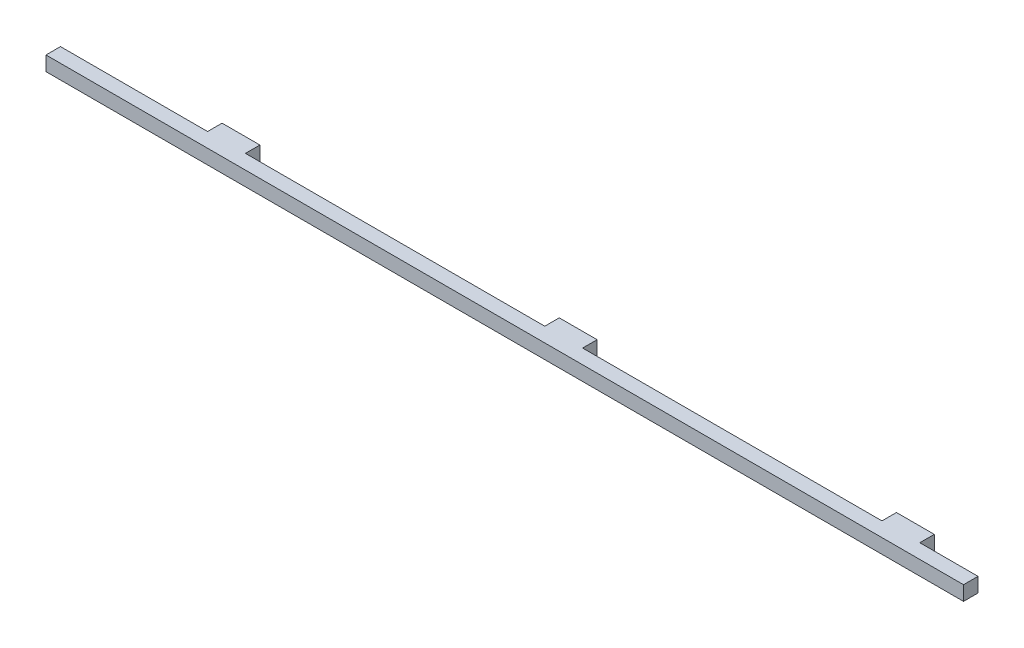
ISO-10303-21;
HEADER;
FILE_DESCRIPTION(('STEP AP214'),'2;1');
FILE_NAME('part.step','',(''),(''),'','','');
FILE_SCHEMA(('AUTOMOTIVE_DESIGN { 1 0 10303 214 1 1 1 1 }'));
ENDSEC;
DATA;
#1=APPLICATION_CONTEXT('core data for automotive mechanical design processes');
#2=APPLICATION_PROTOCOL_DEFINITION('international standard','automotive_design',2000,#1);
#3=PRODUCT_CONTEXT('',#1,'mechanical');
#4=PRODUCT('Part','Part','',(#3));
#5=PRODUCT_RELATED_PRODUCT_CATEGORY('part','',(#4));
#6=PRODUCT_DEFINITION_FORMATION('','',#4);
#7=PRODUCT_DEFINITION_CONTEXT('part definition',#1,'design');
#8=PRODUCT_DEFINITION('design','',#6,#7);
#9=PRODUCT_DEFINITION_SHAPE('','',#8);
#10=(LENGTH_UNIT() NAMED_UNIT(*) SI_UNIT(.MILLI.,.METRE.));
#11=(NAMED_UNIT(*) PLANE_ANGLE_UNIT() SI_UNIT($,.RADIAN.));
#12=(NAMED_UNIT(*) SI_UNIT($,.STERADIAN.) SOLID_ANGLE_UNIT());
#13=UNCERTAINTY_MEASURE_WITH_UNIT(LENGTH_MEASURE(1.E-05),#10,'distance_accuracy_value','');
#14=(GEOMETRIC_REPRESENTATION_CONTEXT(3) GLOBAL_UNCERTAINTY_ASSIGNED_CONTEXT((#13)) GLOBAL_UNIT_ASSIGNED_CONTEXT((#10,
#11,#12)) REPRESENTATION_CONTEXT('',''));
#15=CARTESIAN_POINT('',(0.,0.,0.));
#16=DIRECTION('',(0.,0.,1.));
#17=DIRECTION('',(1.,0.,0.));
#18=AXIS2_PLACEMENT_3D('',#15,#16,#17);
#19=CARTESIAN_POINT('',(-273.841357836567,3.,-103.580258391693));
#20=DIRECTION('',(-1.,0.,0.));
#21=DIRECTION('',(0.,0.,1.));
#22=AXIS2_PLACEMENT_3D('',#19,#20,#21);
#23=PLANE('',#22);
#24=DIRECTION('',(0.,0.,-1.));
#25=VECTOR('',#24,1.);
#26=CARTESIAN_POINT('',(-273.841357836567,0.,-103.580258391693));
#27=LINE('',#26,#25);
#28=CARTESIAN_POINT('',(-273.841357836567,0.,-100.580258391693));
#29=VERTEX_POINT('',#28);
#30=CARTESIAN_POINT('',(-273.841357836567,0.,-103.580258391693));
#31=VERTEX_POINT('',#30);
#32=EDGE_CURVE('E176',#29,#31,#27,.T.);
#33=ORIENTED_EDGE('',*,*,#32,.T.);
#34=DIRECTION('',(0.,-1.,0.));
#35=VECTOR('',#34,1.);
#36=CARTESIAN_POINT('',(-273.841357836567,3.,-103.580258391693));
#37=LINE('',#36,#35);
#38=CARTESIAN_POINT('',(-273.841357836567,3.,-103.580258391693));
#39=VERTEX_POINT('',#38);
#40=EDGE_CURVE('E11',#39,#31,#37,.T.);
#41=ORIENTED_EDGE('',*,*,#40,.F.);
#42=DIRECTION('',(0.,0.,-1.));
#43=VECTOR('',#42,1.);
#44=CARTESIAN_POINT('',(-273.841357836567,3.,-103.580258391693));
#45=LINE('',#44,#43);
#46=CARTESIAN_POINT('',(-273.841357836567,3.,-100.580258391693));
#47=VERTEX_POINT('',#46);
#48=EDGE_CURVE('E206',#47,#39,#45,.T.);
#49=ORIENTED_EDGE('',*,*,#48,.F.);
#50=DIRECTION('',(0.,-1.,0.));
#51=VECTOR('',#50,1.);
#52=CARTESIAN_POINT('',(-273.841357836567,3.,-100.580258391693));
#53=LINE('',#52,#51);
#54=EDGE_CURVE('E172',#47,#29,#53,.T.);
#55=ORIENTED_EDGE('',*,*,#54,.T.);
#56=EDGE_LOOP('',(#33,#41,#49,#55));
#57=FACE_BOUND('',#56,.T.);
#58=ADVANCED_FACE('F32',(#57),#23,.F.);
#59=CARTESIAN_POINT('',(-281.679657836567,3.,-103.580258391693));
#60=DIRECTION('',(0.,0.,1.));
#61=DIRECTION('',(1.,0.,0.));
#62=AXIS2_PLACEMENT_3D('',#59,#60,#61);
#63=PLANE('',#62);
#64=DIRECTION('',(-1.,0.,0.));
#65=VECTOR('',#64,1.);
#66=CARTESIAN_POINT('',(-281.679657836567,0.,-103.580258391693));
#67=LINE('',#66,#65);
#68=CARTESIAN_POINT('',(-281.679657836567,0.,-103.580258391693));
#69=VERTEX_POINT('',#68);
#70=EDGE_CURVE('E179',#31,#69,#67,.T.);
#71=ORIENTED_EDGE('',*,*,#70,.T.);
#72=DIRECTION('',(0.,-1.,0.));
#73=VECTOR('',#72,1.);
#74=CARTESIAN_POINT('',(-281.679657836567,3.,-103.580258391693));
#75=LINE('',#74,#73);
#76=CARTESIAN_POINT('',(-281.679657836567,3.,-103.580258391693));
#77=VERTEX_POINT('',#76);
#78=EDGE_CURVE('E40',#77,#69,#75,.T.);
#79=ORIENTED_EDGE('',*,*,#78,.F.);
#80=DIRECTION('',(-1.,0.,0.));
#81=VECTOR('',#80,1.);
#82=CARTESIAN_POINT('',(-281.679657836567,3.,-103.580258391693));
#83=LINE('',#82,#81);
#84=EDGE_CURVE('E115',#39,#77,#83,.T.);
#85=ORIENTED_EDGE('',*,*,#84,.F.);
#86=ORIENTED_EDGE('',*,*,#40,.T.);
#87=EDGE_LOOP('',(#71,#79,#85,#86));
#88=FACE_BOUND('',#87,.T.);
#89=ADVANCED_FACE('F304',(#88),#63,.F.);
#90=CARTESIAN_POINT('',(-281.679657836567,3.,-103.580258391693));
#91=DIRECTION('',(1.,0.,0.));
#92=DIRECTION('',(0.,0.,-1.));
#93=AXIS2_PLACEMENT_3D('',#90,#91,#92);
#94=PLANE('',#93);
#95=DIRECTION('',(0.,0.,1.));
#96=VECTOR('',#95,1.);
#97=CARTESIAN_POINT('',(-281.679657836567,0.,-103.580258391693));
#98=LINE('',#97,#96);
#99=CARTESIAN_POINT('',(-281.679657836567,0.,-100.580258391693));
#100=VERTEX_POINT('',#99);
#101=EDGE_CURVE('E181',#69,#100,#98,.T.);
#102=ORIENTED_EDGE('',*,*,#101,.T.);
#103=DIRECTION('',(0.,-1.,0.));
#104=VECTOR('',#103,1.);
#105=CARTESIAN_POINT('',(-281.679657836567,3.,-100.580258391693));
#106=LINE('',#105,#104);
#107=CARTESIAN_POINT('',(-281.679657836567,3.,-100.580258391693));
#108=VERTEX_POINT('',#107);
#109=EDGE_CURVE('E237',#108,#100,#106,.T.);
#110=ORIENTED_EDGE('',*,*,#109,.F.);
#111=DIRECTION('',(0.,0.,1.));
#112=VECTOR('',#111,1.);
#113=CARTESIAN_POINT('',(-281.679657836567,3.,-103.580258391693));
#114=LINE('',#113,#112);
#115=EDGE_CURVE('E245',#77,#108,#114,.T.);
#116=ORIENTED_EDGE('',*,*,#115,.F.);
#117=ORIENTED_EDGE('',*,*,#78,.T.);
#118=EDGE_LOOP('',(#102,#110,#116,#117));
#119=FACE_BOUND('',#118,.T.);
#120=ADVANCED_FACE('F243',(#119),#94,.F.);
#121=CARTESIAN_POINT('',(-281.679657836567,3.,-100.580258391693));
#122=DIRECTION('',(0.,0.,1.));
#123=DIRECTION('',(1.,0.,0.));
#124=AXIS2_PLACEMENT_3D('',#121,#122,#123);
#125=PLANE('',#124);
#126=DIRECTION('',(-1.,0.,0.));
#127=VECTOR('',#126,1.);
#128=CARTESIAN_POINT('',(-281.679657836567,0.,-100.580258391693));
#129=LINE('',#128,#127);
#130=CARTESIAN_POINT('',(-312.140557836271,0.,-100.580258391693));
#131=VERTEX_POINT('',#130);
#132=EDGE_CURVE('E183',#100,#131,#129,.T.);
#133=ORIENTED_EDGE('',*,*,#132,.T.);
#134=DIRECTION('',(0.,-1.,0.));
#135=VECTOR('',#134,1.);
#136=CARTESIAN_POINT('',(-312.140557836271,3.,-100.580258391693));
#137=LINE('',#136,#135);
#138=CARTESIAN_POINT('',(-312.140557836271,3.,-100.580258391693));
#139=VERTEX_POINT('',#138);
#140=EDGE_CURVE('E234',#139,#131,#137,.T.);
#141=ORIENTED_EDGE('',*,*,#140,.F.);
#142=DIRECTION('',(-1.,0.,0.));
#143=VECTOR('',#142,1.);
#144=CARTESIAN_POINT('',(-281.679657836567,3.,-100.580258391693));
#145=LINE('',#144,#143);
#146=EDGE_CURVE('E263',#108,#139,#145,.T.);
#147=ORIENTED_EDGE('',*,*,#146,.F.);
#148=ORIENTED_EDGE('',*,*,#109,.T.);
#149=EDGE_LOOP('',(#133,#141,#147,#148));
#150=FACE_BOUND('',#149,.T.);
#151=ADVANCED_FACE('F254',(#150),#125,.F.);
#152=CARTESIAN_POINT('',(-312.140557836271,3.,-100.580258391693));
#153=DIRECTION('',(1.,0.,0.));
#154=DIRECTION('',(0.,0.,-1.));
#155=AXIS2_PLACEMENT_3D('',#152,#153,#154);
#156=PLANE('',#155);
#157=DIRECTION('',(0.,0.,1.));
#158=VECTOR('',#157,1.);
#159=CARTESIAN_POINT('',(-312.140557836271,0.,-100.580258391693));
#160=LINE('',#159,#158);
#161=CARTESIAN_POINT('',(-312.140557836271,0.,-97.5802583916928));
#162=VERTEX_POINT('',#161);
#163=EDGE_CURVE('E185',#131,#162,#160,.T.);
#164=ORIENTED_EDGE('',*,*,#163,.T.);
#165=DIRECTION('',(0.,-1.,0.));
#166=VECTOR('',#165,1.);
#167=CARTESIAN_POINT('',(-312.140557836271,3.,-97.5802583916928));
#168=LINE('',#167,#166);
#169=CARTESIAN_POINT('',(-312.140557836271,3.,-97.5802583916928));
#170=VERTEX_POINT('',#169);
#171=EDGE_CURVE('E231',#170,#162,#168,.T.);
#172=ORIENTED_EDGE('',*,*,#171,.F.);
#173=DIRECTION('',(0.,0.,1.));
#174=VECTOR('',#173,1.);
#175=CARTESIAN_POINT('',(-312.140557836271,3.,-100.580258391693));
#176=LINE('',#175,#174);
#177=EDGE_CURVE('E260',#139,#170,#176,.T.);
#178=ORIENTED_EDGE('',*,*,#177,.F.);
#179=ORIENTED_EDGE('',*,*,#140,.T.);
#180=EDGE_LOOP('',(#164,#172,#178,#179));
#181=FACE_BOUND('',#180,.T.);
#182=ADVANCED_FACE('F258',(#181),#156,.F.);
#183=CARTESIAN_POINT('',(-312.140557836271,3.,-97.5802583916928));
#184=DIRECTION('',(0.,0.,-1.));
#185=DIRECTION('',(-1.,0.,0.));
#186=AXIS2_PLACEMENT_3D('',#183,#184,#185);
#187=PLANE('',#186);
#188=DIRECTION('',(1.,0.,0.));
#189=VECTOR('',#188,1.);
#190=CARTESIAN_POINT('',(-312.140557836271,0.,-97.5802583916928));
#191=LINE('',#190,#189);
#192=CARTESIAN_POINT('',(-122.140557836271,0.,-97.5802583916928));
#193=VERTEX_POINT('',#192);
#194=EDGE_CURVE('E187',#162,#193,#191,.T.);
#195=ORIENTED_EDGE('',*,*,#194,.T.);
#196=DIRECTION('',(0.,-1.,0.));
#197=VECTOR('',#196,1.);
#198=CARTESIAN_POINT('',(-122.140557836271,3.,-97.5802583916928));
#199=LINE('',#198,#197);
#200=CARTESIAN_POINT('',(-122.140557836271,3.,-97.5802583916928));
#201=VERTEX_POINT('',#200);
#202=EDGE_CURVE('E228',#201,#193,#199,.T.);
#203=ORIENTED_EDGE('',*,*,#202,.F.);
#204=DIRECTION('',(1.,0.,0.));
#205=VECTOR('',#204,1.);
#206=CARTESIAN_POINT('',(-312.140557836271,3.,-97.5802583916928));
#207=LINE('',#206,#205);
#208=EDGE_CURVE('E262',#170,#201,#207,.T.);
#209=ORIENTED_EDGE('',*,*,#208,.F.);
#210=ORIENTED_EDGE('',*,*,#171,.T.);
#211=EDGE_LOOP('',(#195,#203,#209,#210));
#212=FACE_BOUND('',#211,.T.);
#213=ADVANCED_FACE('F317',(#212),#187,.F.);
#214=CARTESIAN_POINT('',(-122.140557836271,3.,-97.5802583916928));
#215=DIRECTION('',(-1.,0.,0.));
#216=DIRECTION('',(0.,0.,1.));
#217=AXIS2_PLACEMENT_3D('',#214,#215,#216);
#218=PLANE('',#217);
#219=DIRECTION('',(0.,0.,-1.));
#220=VECTOR('',#219,1.);
#221=CARTESIAN_POINT('',(-122.140557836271,0.,-97.5802583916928));
#222=LINE('',#221,#220);
#223=CARTESIAN_POINT('',(-122.140557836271,0.,-100.580258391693));
#224=VERTEX_POINT('',#223);
#225=EDGE_CURVE('E189',#193,#224,#222,.T.);
#226=ORIENTED_EDGE('',*,*,#225,.T.);
#227=DIRECTION('',(0.,-1.,0.));
#228=VECTOR('',#227,1.);
#229=CARTESIAN_POINT('',(-122.140557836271,3.,-100.580258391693));
#230=LINE('',#229,#228);
#231=CARTESIAN_POINT('',(-122.140557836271,3.,-100.580258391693));
#232=VERTEX_POINT('',#231);
#233=EDGE_CURVE('E225',#232,#224,#230,.T.);
#234=ORIENTED_EDGE('',*,*,#233,.F.);
#235=DIRECTION('',(0.,0.,-1.));
#236=VECTOR('',#235,1.);
#237=CARTESIAN_POINT('',(-122.140557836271,3.,-97.5802583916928));
#238=LINE('',#237,#236);
#239=EDGE_CURVE('E265',#201,#232,#238,.T.);
#240=ORIENTED_EDGE('',*,*,#239,.F.);
#241=ORIENTED_EDGE('',*,*,#202,.T.);
#242=EDGE_LOOP('',(#226,#234,#240,#241));
#243=FACE_BOUND('',#242,.T.);
#244=ADVANCED_FACE('F320',(#243),#218,.F.);
#245=CARTESIAN_POINT('',(-134.190457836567,3.,-100.580258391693));
#246=DIRECTION('',(0.,0.,1.));
#247=DIRECTION('',(1.,0.,0.));
#248=AXIS2_PLACEMENT_3D('',#245,#246,#247);
#249=PLANE('',#248);
#250=DIRECTION('',(-1.,0.,0.));
#251=VECTOR('',#250,1.);
#252=CARTESIAN_POINT('',(-134.190457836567,0.,-100.580258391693));
#253=LINE('',#252,#251);
#254=CARTESIAN_POINT('',(-134.190457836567,0.,-100.580258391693));
#255=VERTEX_POINT('',#254);
#256=EDGE_CURVE('E191',#224,#255,#253,.T.);
#257=ORIENTED_EDGE('',*,*,#256,.T.);
#258=DIRECTION('',(0.,-1.,0.));
#259=VECTOR('',#258,1.);
#260=CARTESIAN_POINT('',(-134.190457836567,3.,-100.580258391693));
#261=LINE('',#260,#259);
#262=CARTESIAN_POINT('',(-134.190457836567,3.,-100.580258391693));
#263=VERTEX_POINT('',#262);
#264=EDGE_CURVE('E222',#263,#255,#261,.T.);
#265=ORIENTED_EDGE('',*,*,#264,.F.);
#266=DIRECTION('',(-1.,0.,0.));
#267=VECTOR('',#266,1.);
#268=CARTESIAN_POINT('',(-134.190457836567,3.,-100.580258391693));
#269=LINE('',#268,#267);
#270=EDGE_CURVE('E271',#232,#263,#269,.T.);
#271=ORIENTED_EDGE('',*,*,#270,.F.);
#272=ORIENTED_EDGE('',*,*,#233,.T.);
#273=EDGE_LOOP('',(#257,#265,#271,#272));
#274=FACE_BOUND('',#273,.T.);
#275=ADVANCED_FACE('F324',(#274),#249,.F.);
#276=CARTESIAN_POINT('',(-134.190457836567,3.,-103.580258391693));
#277=DIRECTION('',(-1.,0.,0.));
#278=DIRECTION('',(0.,0.,1.));
#279=AXIS2_PLACEMENT_3D('',#276,#277,#278);
#280=PLANE('',#279);
#281=DIRECTION('',(0.,0.,-1.));
#282=VECTOR('',#281,1.);
#283=CARTESIAN_POINT('',(-134.190457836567,0.,-103.580258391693));
#284=LINE('',#283,#282);
#285=CARTESIAN_POINT('',(-134.190457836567,0.,-103.580258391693));
#286=VERTEX_POINT('',#285);
#287=EDGE_CURVE('E193',#255,#286,#284,.T.);
#288=ORIENTED_EDGE('',*,*,#287,.T.);
#289=DIRECTION('',(0.,-1.,0.));
#290=VECTOR('',#289,1.);
#291=CARTESIAN_POINT('',(-134.190457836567,3.,-103.580258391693));
#292=LINE('',#291,#290);
#293=CARTESIAN_POINT('',(-134.190457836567,3.,-103.580258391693));
#294=VERTEX_POINT('',#293);
#295=EDGE_CURVE('E219',#294,#286,#292,.T.);
#296=ORIENTED_EDGE('',*,*,#295,.F.);
#297=DIRECTION('',(0.,0.,-1.));
#298=VECTOR('',#297,1.);
#299=CARTESIAN_POINT('',(-134.190457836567,3.,-103.580258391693));
#300=LINE('',#299,#298);
#301=EDGE_CURVE('E273',#263,#294,#300,.T.);
#302=ORIENTED_EDGE('',*,*,#301,.F.);
#303=ORIENTED_EDGE('',*,*,#264,.T.);
#304=EDGE_LOOP('',(#288,#296,#302,#303));
#305=FACE_BOUND('',#304,.T.);
#306=ADVANCED_FACE('F328',(#305),#280,.F.);
#307=CARTESIAN_POINT('',(-142.028857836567,3.,-103.580258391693));
#308=DIRECTION('',(0.,0.,1.));
#309=DIRECTION('',(1.,0.,0.));
#310=AXIS2_PLACEMENT_3D('',#307,#308,#309);
#311=PLANE('',#310);
#312=DIRECTION('',(-1.,0.,0.));
#313=VECTOR('',#312,1.);
#314=CARTESIAN_POINT('',(-142.028857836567,0.,-103.580258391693));
#315=LINE('',#314,#313);
#316=CARTESIAN_POINT('',(-142.028857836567,0.,-103.580258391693));
#317=VERTEX_POINT('',#316);
#318=EDGE_CURVE('E195',#286,#317,#315,.T.);
#319=ORIENTED_EDGE('',*,*,#318,.T.);
#320=DIRECTION('',(0.,-1.,0.));
#321=VECTOR('',#320,1.);
#322=CARTESIAN_POINT('',(-142.028857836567,3.,-103.580258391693));
#323=LINE('',#322,#321);
#324=CARTESIAN_POINT('',(-142.028857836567,3.,-103.580258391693));
#325=VERTEX_POINT('',#324);
#326=EDGE_CURVE('E216',#325,#317,#323,.T.);
#327=ORIENTED_EDGE('',*,*,#326,.F.);
#328=DIRECTION('',(-1.,0.,0.));
#329=VECTOR('',#328,1.);
#330=CARTESIAN_POINT('',(-142.028857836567,3.,-103.580258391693));
#331=LINE('',#330,#329);
#332=EDGE_CURVE('E275',#294,#325,#331,.T.);
#333=ORIENTED_EDGE('',*,*,#332,.F.);
#334=ORIENTED_EDGE('',*,*,#295,.T.);
#335=EDGE_LOOP('',(#319,#327,#333,#334));
#336=FACE_BOUND('',#335,.T.);
#337=ADVANCED_FACE('F332',(#336),#311,.F.);
#338=CARTESIAN_POINT('',(-142.028857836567,3.,-103.580258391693));
#339=DIRECTION('',(1.,0.,0.));
#340=DIRECTION('',(0.,0.,-1.));
#341=AXIS2_PLACEMENT_3D('',#338,#339,#340);
#342=PLANE('',#341);
#343=DIRECTION('',(0.,0.,1.));
#344=VECTOR('',#343,1.);
#345=CARTESIAN_POINT('',(-142.028857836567,0.,-103.580258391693));
#346=LINE('',#345,#344);
#347=CARTESIAN_POINT('',(-142.028857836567,0.,-100.580258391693));
#348=VERTEX_POINT('',#347);
#349=EDGE_CURVE('E197',#317,#348,#346,.T.);
#350=ORIENTED_EDGE('',*,*,#349,.T.);
#351=DIRECTION('',(0.,-1.,0.));
#352=VECTOR('',#351,1.);
#353=CARTESIAN_POINT('',(-142.028857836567,3.,-100.580258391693));
#354=LINE('',#353,#352);
#355=CARTESIAN_POINT('',(-142.028857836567,3.,-100.580258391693));
#356=VERTEX_POINT('',#355);
#357=EDGE_CURVE('E213',#356,#348,#354,.T.);
#358=ORIENTED_EDGE('',*,*,#357,.F.);
#359=DIRECTION('',(0.,0.,1.));
#360=VECTOR('',#359,1.);
#361=CARTESIAN_POINT('',(-142.028857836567,3.,-103.580258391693));
#362=LINE('',#361,#360);
#363=EDGE_CURVE('E277',#325,#356,#362,.T.);
#364=ORIENTED_EDGE('',*,*,#363,.F.);
#365=ORIENTED_EDGE('',*,*,#326,.T.);
#366=EDGE_LOOP('',(#350,#358,#364,#365));
#367=FACE_BOUND('',#366,.T.);
#368=ADVANCED_FACE('F336',(#367),#342,.F.);
#369=CARTESIAN_POINT('',(-204.015857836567,3.,-100.580258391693));
#370=DIRECTION('',(0.,0.,1.));
#371=DIRECTION('',(1.,0.,0.));
#372=AXIS2_PLACEMENT_3D('',#369,#370,#371);
#373=PLANE('',#372);
#374=DIRECTION('',(-1.,0.,0.));
#375=VECTOR('',#374,1.);
#376=CARTESIAN_POINT('',(-204.015857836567,0.,-100.580258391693));
#377=LINE('',#376,#375);
#378=CARTESIAN_POINT('',(-204.015857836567,0.,-100.580258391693));
#379=VERTEX_POINT('',#378);
#380=EDGE_CURVE('E199',#348,#379,#377,.T.);
#381=ORIENTED_EDGE('',*,*,#380,.T.);
#382=DIRECTION('',(0.,-1.,0.));
#383=VECTOR('',#382,1.);
#384=CARTESIAN_POINT('',(-204.015857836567,3.,-100.580258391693));
#385=LINE('',#384,#383);
#386=CARTESIAN_POINT('',(-204.015857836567,3.,-100.580258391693));
#387=VERTEX_POINT('',#386);
#388=EDGE_CURVE('E210',#387,#379,#385,.T.);
#389=ORIENTED_EDGE('',*,*,#388,.F.);
#390=DIRECTION('',(-1.,0.,0.));
#391=VECTOR('',#390,1.);
#392=CARTESIAN_POINT('',(-204.015857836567,3.,-100.580258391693));
#393=LINE('',#392,#391);
#394=EDGE_CURVE('E279',#356,#387,#393,.T.);
#395=ORIENTED_EDGE('',*,*,#394,.F.);
#396=ORIENTED_EDGE('',*,*,#357,.T.);
#397=EDGE_LOOP('',(#381,#389,#395,#396));
#398=FACE_BOUND('',#397,.T.);
#399=ADVANCED_FACE('F285',(#398),#373,.F.);
#400=CARTESIAN_POINT('',(-204.015857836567,3.,-103.580258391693));
#401=DIRECTION('',(-1.,0.,0.));
#402=DIRECTION('',(0.,0.,1.));
#403=AXIS2_PLACEMENT_3D('',#400,#401,#402);
#404=PLANE('',#403);
#405=DIRECTION('',(0.,0.,-1.));
#406=VECTOR('',#405,1.);
#407=CARTESIAN_POINT('',(-204.015857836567,0.,-103.580258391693));
#408=LINE('',#407,#406);
#409=CARTESIAN_POINT('',(-204.015857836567,0.,-103.580258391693));
#410=VERTEX_POINT('',#409);
#411=EDGE_CURVE('E201',#379,#410,#408,.T.);
#412=ORIENTED_EDGE('',*,*,#411,.T.);
#413=DIRECTION('',(0.,-1.,0.));
#414=VECTOR('',#413,1.);
#415=CARTESIAN_POINT('',(-204.015857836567,3.,-103.580258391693));
#416=LINE('',#415,#414);
#417=CARTESIAN_POINT('',(-204.015857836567,3.,-103.580258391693));
#418=VERTEX_POINT('',#417);
#419=EDGE_CURVE('E167',#418,#410,#416,.T.);
#420=ORIENTED_EDGE('',*,*,#419,.F.);
#421=DIRECTION('',(0.,0.,-1.));
#422=VECTOR('',#421,1.);
#423=CARTESIAN_POINT('',(-204.015857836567,3.,-103.580258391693));
#424=LINE('',#423,#422);
#425=EDGE_CURVE('E158',#387,#418,#424,.T.);
#426=ORIENTED_EDGE('',*,*,#425,.F.);
#427=ORIENTED_EDGE('',*,*,#388,.T.);
#428=EDGE_LOOP('',(#412,#420,#426,#427));
#429=FACE_BOUND('',#428,.T.);
#430=ADVANCED_FACE('F289',(#429),#404,.F.);
#431=CARTESIAN_POINT('',(-211.854057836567,3.,-103.580258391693));
#432=DIRECTION('',(0.,0.,1.));
#433=DIRECTION('',(1.,0.,0.));
#434=AXIS2_PLACEMENT_3D('',#431,#432,#433);
#435=PLANE('',#434);
#436=DIRECTION('',(-1.,0.,0.));
#437=VECTOR('',#436,1.);
#438=CARTESIAN_POINT('',(-211.854057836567,0.,-103.580258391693));
#439=LINE('',#438,#437);
#440=CARTESIAN_POINT('',(-211.854057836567,0.,-103.580258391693));
#441=VERTEX_POINT('',#440);
#442=EDGE_CURVE('E166',#410,#441,#439,.T.);
#443=ORIENTED_EDGE('',*,*,#442,.T.);
#444=DIRECTION('',(0.,-1.,0.));
#445=VECTOR('',#444,1.);
#446=CARTESIAN_POINT('',(-211.854057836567,3.,-103.580258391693));
#447=LINE('',#446,#445);
#448=CARTESIAN_POINT('',(-211.854057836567,3.,-103.580258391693));
#449=VERTEX_POINT('',#448);
#450=EDGE_CURVE('E163',#449,#441,#447,.T.);
#451=ORIENTED_EDGE('',*,*,#450,.F.);
#452=DIRECTION('',(-1.,0.,0.));
#453=VECTOR('',#452,1.);
#454=CARTESIAN_POINT('',(-211.854057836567,3.,-103.580258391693));
#455=LINE('',#454,#453);
#456=EDGE_CURVE('E152',#418,#449,#455,.T.);
#457=ORIENTED_EDGE('',*,*,#456,.F.);
#458=ORIENTED_EDGE('',*,*,#419,.T.);
#459=EDGE_LOOP('',(#443,#451,#457,#458));
#460=FACE_BOUND('',#459,.T.);
#461=ADVANCED_FACE('F164',(#460),#435,.F.);
#462=CARTESIAN_POINT('',(-211.854057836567,3.,-103.580258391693));
#463=DIRECTION('',(1.,0.,0.));
#464=DIRECTION('',(0.,0.,-1.));
#465=AXIS2_PLACEMENT_3D('',#462,#463,#464);
#466=PLANE('',#465);
#467=DIRECTION('',(0.,0.,1.));
#468=VECTOR('',#467,1.);
#469=CARTESIAN_POINT('',(-211.854057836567,0.,-103.580258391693));
#470=LINE('',#469,#468);
#471=CARTESIAN_POINT('',(-211.854057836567,0.,-100.580258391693));
#472=VERTEX_POINT('',#471);
#473=EDGE_CURVE('E101',#441,#472,#470,.T.);
#474=ORIENTED_EDGE('',*,*,#473,.T.);
#475=DIRECTION('',(0.,-1.,0.));
#476=VECTOR('',#475,1.);
#477=CARTESIAN_POINT('',(-211.854057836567,3.,-100.580258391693));
#478=LINE('',#477,#476);
#479=CARTESIAN_POINT('',(-211.854057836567,3.,-100.580258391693));
#480=VERTEX_POINT('',#479);
#481=EDGE_CURVE('E168',#480,#472,#478,.T.);
#482=ORIENTED_EDGE('',*,*,#481,.F.);
#483=DIRECTION('',(0.,0.,1.));
#484=VECTOR('',#483,1.);
#485=CARTESIAN_POINT('',(-211.854057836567,3.,-103.580258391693));
#486=LINE('',#485,#484);
#487=EDGE_CURVE('E156',#449,#480,#486,.T.);
#488=ORIENTED_EDGE('',*,*,#487,.F.);
#489=ORIENTED_EDGE('',*,*,#450,.T.);
#490=EDGE_LOOP('',(#474,#482,#488,#489));
#491=FACE_BOUND('',#490,.T.);
#492=ADVANCED_FACE('F170',(#491),#466,.F.);
#493=CARTESIAN_POINT('',(-273.841357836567,3.,-100.580258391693));
#494=DIRECTION('',(0.,0.,1.));
#495=DIRECTION('',(1.,0.,0.));
#496=AXIS2_PLACEMENT_3D('',#493,#494,#495);
#497=PLANE('',#496);
#498=DIRECTION('',(-1.,0.,0.));
#499=VECTOR('',#498,1.);
#500=CARTESIAN_POINT('',(-273.841357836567,0.,-100.580258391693));
#501=LINE('',#500,#499);
#502=EDGE_CURVE('E107',#472,#29,#501,.T.);
#503=ORIENTED_EDGE('',*,*,#502,.T.);
#504=ORIENTED_EDGE('',*,*,#54,.F.);
#505=DIRECTION('',(-1.,0.,0.));
#506=VECTOR('',#505,1.);
#507=CARTESIAN_POINT('',(-273.841357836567,3.,-100.580258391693));
#508=LINE('',#507,#506);
#509=EDGE_CURVE('E48',#480,#47,#508,.T.);
#510=ORIENTED_EDGE('',*,*,#509,.F.);
#511=ORIENTED_EDGE('',*,*,#481,.T.);
#512=EDGE_LOOP('',(#503,#504,#510,#511));
#513=FACE_BOUND('',#512,.T.);
#514=ADVANCED_FACE('F293',(#513),#497,.F.);
#515=CARTESIAN_POINT('',(0.,3.,0.));
#516=DIRECTION('',(0.,1.,0.));
#517=DIRECTION('',(0.,0.,1.));
#518=AXIS2_PLACEMENT_3D('',#515,#516,#517);
#519=PLANE('',#518);
#520=ORIENTED_EDGE('',*,*,#48,.T.);
#521=ORIENTED_EDGE('',*,*,#84,.T.);
#522=ORIENTED_EDGE('',*,*,#115,.T.);
#523=ORIENTED_EDGE('',*,*,#146,.T.);
#524=ORIENTED_EDGE('',*,*,#177,.T.);
#525=ORIENTED_EDGE('',*,*,#208,.T.);
#526=ORIENTED_EDGE('',*,*,#239,.T.);
#527=ORIENTED_EDGE('',*,*,#270,.T.);
#528=ORIENTED_EDGE('',*,*,#301,.T.);
#529=ORIENTED_EDGE('',*,*,#332,.T.);
#530=ORIENTED_EDGE('',*,*,#363,.T.);
#531=ORIENTED_EDGE('',*,*,#394,.T.);
#532=ORIENTED_EDGE('',*,*,#425,.T.);
#533=ORIENTED_EDGE('',*,*,#456,.T.);
#534=ORIENTED_EDGE('',*,*,#487,.T.);
#535=ORIENTED_EDGE('',*,*,#509,.T.);
#536=EDGE_LOOP('',(#520,#521,#522,#523,#524,#525,#526,#527,#528,#529,#530,#531,#532,#533,#534,#535));
#537=FACE_BOUND('',#536,.T.);
#538=ADVANCED_FACE('F154',(#537),#519,.T.);
#539=CARTESIAN_POINT('',(0.,0.,0.));
#540=DIRECTION('',(0.,1.,0.));
#541=DIRECTION('',(0.,0.,1.));
#542=AXIS2_PLACEMENT_3D('',#539,#540,#541);
#543=PLANE('',#542);
#544=ORIENTED_EDGE('',*,*,#32,.F.);
#545=ORIENTED_EDGE('',*,*,#502,.F.);
#546=ORIENTED_EDGE('',*,*,#473,.F.);
#547=ORIENTED_EDGE('',*,*,#442,.F.);
#548=ORIENTED_EDGE('',*,*,#411,.F.);
#549=ORIENTED_EDGE('',*,*,#380,.F.);
#550=ORIENTED_EDGE('',*,*,#349,.F.);
#551=ORIENTED_EDGE('',*,*,#318,.F.);
#552=ORIENTED_EDGE('',*,*,#287,.F.);
#553=ORIENTED_EDGE('',*,*,#256,.F.);
#554=ORIENTED_EDGE('',*,*,#225,.F.);
#555=ORIENTED_EDGE('',*,*,#194,.F.);
#556=ORIENTED_EDGE('',*,*,#163,.F.);
#557=ORIENTED_EDGE('',*,*,#132,.F.);
#558=ORIENTED_EDGE('',*,*,#101,.F.);
#559=ORIENTED_EDGE('',*,*,#70,.F.);
#560=EDGE_LOOP('',(#544,#545,#546,#547,#548,#549,#550,#551,#552,#553,#554,#555,#556,#557,#558,#559));
#561=FACE_BOUND('',#560,.T.);
#562=ADVANCED_FACE('F249',(#561),#543,.F.);
#563=CLOSED_SHELL('',(#58,#89,#120,#151,#182,#213,#244,#275,#306,#337,#368,#399,#430,#461,#492,
#514,#538,#562));
#564=MANIFOLD_SOLID_BREP('B2',#563);
#565=ADVANCED_BREP_SHAPE_REPRESENTATION('',(#18,#564),#14);
#566=SHAPE_DEFINITION_REPRESENTATION(#9,#565);
ENDSEC;
END-ISO-10303-21;
